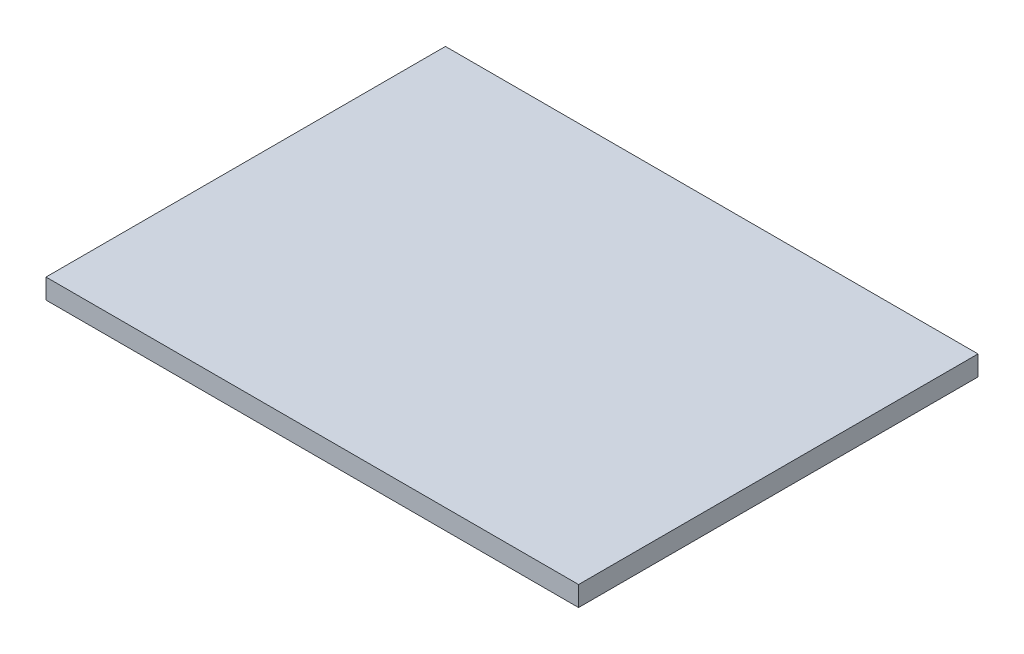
ISO-10303-21;
HEADER;
FILE_DESCRIPTION(('STEP AP214'),'2;1');
FILE_NAME('part.step','',(''),(''),'','','');
FILE_SCHEMA(('AUTOMOTIVE_DESIGN { 1 0 10303 214 1 1 1 1 }'));
ENDSEC;
DATA;
#1=APPLICATION_CONTEXT('core data for automotive mechanical design processes');
#2=APPLICATION_PROTOCOL_DEFINITION('international standard','automotive_design',2000,#1);
#3=PRODUCT_CONTEXT('',#1,'mechanical');
#4=PRODUCT('Part','Part','',(#3));
#5=PRODUCT_RELATED_PRODUCT_CATEGORY('part','',(#4));
#6=PRODUCT_DEFINITION_FORMATION('','',#4);
#7=PRODUCT_DEFINITION_CONTEXT('part definition',#1,'design');
#8=PRODUCT_DEFINITION('design','',#6,#7);
#9=PRODUCT_DEFINITION_SHAPE('','',#8);
#10=(LENGTH_UNIT() NAMED_UNIT(*) SI_UNIT(.MILLI.,.METRE.));
#11=(NAMED_UNIT(*) PLANE_ANGLE_UNIT() SI_UNIT($,.RADIAN.));
#12=(NAMED_UNIT(*) SI_UNIT($,.STERADIAN.) SOLID_ANGLE_UNIT());
#13=UNCERTAINTY_MEASURE_WITH_UNIT(LENGTH_MEASURE(1.E-05),#10,'distance_accuracy_value','');
#14=(GEOMETRIC_REPRESENTATION_CONTEXT(3) GLOBAL_UNCERTAINTY_ASSIGNED_CONTEXT((#13)) GLOBAL_UNIT_ASSIGNED_CONTEXT((#10,
#11,#12)) REPRESENTATION_CONTEXT('',''));
#15=CARTESIAN_POINT('',(0.,0.,0.));
#16=DIRECTION('',(0.,0.,1.));
#17=DIRECTION('',(1.,0.,0.));
#18=AXIS2_PLACEMENT_3D('',#15,#16,#17);
#19=CARTESIAN_POINT('',(200.,15.,-150.));
#20=DIRECTION('',(-1.,0.,0.));
#21=DIRECTION('',(0.,0.,1.));
#22=AXIS2_PLACEMENT_3D('',#19,#20,#21);
#23=PLANE('',#22);
#24=DIRECTION('',(0.,0.,-1.));
#25=VECTOR('',#24,1.);
#26=CARTESIAN_POINT('',(200.,0.,-150.));
#27=LINE('',#26,#25);
#28=CARTESIAN_POINT('',(200.,0.,150.));
#29=VERTEX_POINT('',#28);
#30=CARTESIAN_POINT('',(200.,0.,-150.));
#31=VERTEX_POINT('',#30);
#32=EDGE_CURVE('E97',#29,#31,#27,.T.);
#33=ORIENTED_EDGE('',*,*,#32,.T.);
#34=DIRECTION('',(0.,-1.,0.));
#35=VECTOR('',#34,1.);
#36=CARTESIAN_POINT('',(200.,15.,-150.));
#37=LINE('',#36,#35);
#38=CARTESIAN_POINT('',(200.,15.,-150.));
#39=VERTEX_POINT('',#38);
#40=EDGE_CURVE('E11',#39,#31,#37,.T.);
#41=ORIENTED_EDGE('',*,*,#40,.F.);
#42=DIRECTION('',(0.,0.,-1.));
#43=VECTOR('',#42,1.);
#44=CARTESIAN_POINT('',(200.,15.,-150.));
#45=LINE('',#44,#43);
#46=CARTESIAN_POINT('',(200.,15.,150.));
#47=VERTEX_POINT('',#46);
#48=EDGE_CURVE('E85',#47,#39,#45,.T.);
#49=ORIENTED_EDGE('',*,*,#48,.F.);
#50=DIRECTION('',(0.,-1.,0.));
#51=VECTOR('',#50,1.);
#52=CARTESIAN_POINT('',(200.,15.,150.));
#53=LINE('',#52,#51);
#54=EDGE_CURVE('E93',#47,#29,#53,.T.);
#55=ORIENTED_EDGE('',*,*,#54,.T.);
#56=EDGE_LOOP('',(#33,#41,#49,#55));
#57=FACE_BOUND('',#56,.T.);
#58=ADVANCED_FACE('F34',(#57),#23,.F.);
#59=CARTESIAN_POINT('',(-200.,15.,-150.));
#60=DIRECTION('',(0.,0.,1.));
#61=DIRECTION('',(1.,0.,0.));
#62=AXIS2_PLACEMENT_3D('',#59,#60,#61);
#63=PLANE('',#62);
#64=DIRECTION('',(-1.,0.,0.));
#65=VECTOR('',#64,1.);
#66=CARTESIAN_POINT('',(-200.,0.,-150.));
#67=LINE('',#66,#65);
#68=CARTESIAN_POINT('',(-200.,0.,-150.));
#69=VERTEX_POINT('',#68);
#70=EDGE_CURVE('E89',#31,#69,#67,.T.);
#71=ORIENTED_EDGE('',*,*,#70,.T.);
#72=DIRECTION('',(0.,-1.,0.));
#73=VECTOR('',#72,1.);
#74=CARTESIAN_POINT('',(-200.,15.,-150.));
#75=LINE('',#74,#73);
#76=CARTESIAN_POINT('',(-200.,15.,-150.));
#77=VERTEX_POINT('',#76);
#78=EDGE_CURVE('E42',#77,#69,#75,.T.);
#79=ORIENTED_EDGE('',*,*,#78,.F.);
#80=DIRECTION('',(-1.,0.,0.));
#81=VECTOR('',#80,1.);
#82=CARTESIAN_POINT('',(-200.,15.,-150.));
#83=LINE('',#82,#81);
#84=EDGE_CURVE('E80',#39,#77,#83,.T.);
#85=ORIENTED_EDGE('',*,*,#84,.F.);
#86=ORIENTED_EDGE('',*,*,#40,.T.);
#87=EDGE_LOOP('',(#71,#79,#85,#86));
#88=FACE_BOUND('',#87,.T.);
#89=ADVANCED_FACE('F88',(#88),#63,.F.);
#90=CARTESIAN_POINT('',(-200.,15.,-150.));
#91=DIRECTION('',(1.,0.,0.));
#92=DIRECTION('',(0.,0.,-1.));
#93=AXIS2_PLACEMENT_3D('',#90,#91,#92);
#94=PLANE('',#93);
#95=DIRECTION('',(0.,0.,1.));
#96=VECTOR('',#95,1.);
#97=CARTESIAN_POINT('',(-200.,0.,-150.));
#98=LINE('',#97,#96);
#99=CARTESIAN_POINT('',(-200.,0.,150.));
#100=VERTEX_POINT('',#99);
#101=EDGE_CURVE('E67',#69,#100,#98,.T.);
#102=ORIENTED_EDGE('',*,*,#101,.T.);
#103=DIRECTION('',(0.,-1.,0.));
#104=VECTOR('',#103,1.);
#105=CARTESIAN_POINT('',(-200.,15.,150.));
#106=LINE('',#105,#104);
#107=CARTESIAN_POINT('',(-200.,15.,150.));
#108=VERTEX_POINT('',#107);
#109=EDGE_CURVE('E90',#108,#100,#106,.T.);
#110=ORIENTED_EDGE('',*,*,#109,.F.);
#111=DIRECTION('',(0.,0.,1.));
#112=VECTOR('',#111,1.);
#113=CARTESIAN_POINT('',(-200.,15.,-150.));
#114=LINE('',#113,#112);
#115=EDGE_CURVE('E83',#77,#108,#114,.T.);
#116=ORIENTED_EDGE('',*,*,#115,.F.);
#117=ORIENTED_EDGE('',*,*,#78,.T.);
#118=EDGE_LOOP('',(#102,#110,#116,#117));
#119=FACE_BOUND('',#118,.T.);
#120=ADVANCED_FACE('F91',(#119),#94,.F.);
#121=CARTESIAN_POINT('',(-200.,15.,150.));
#122=DIRECTION('',(0.,0.,-1.));
#123=DIRECTION('',(-1.,0.,0.));
#124=AXIS2_PLACEMENT_3D('',#121,#122,#123);
#125=PLANE('',#124);
#126=DIRECTION('',(1.,0.,0.));
#127=VECTOR('',#126,1.);
#128=CARTESIAN_POINT('',(-200.,0.,150.));
#129=LINE('',#128,#127);
#130=EDGE_CURVE('E73',#100,#29,#129,.T.);
#131=ORIENTED_EDGE('',*,*,#130,.T.);
#132=ORIENTED_EDGE('',*,*,#54,.F.);
#133=DIRECTION('',(1.,0.,0.));
#134=VECTOR('',#133,1.);
#135=CARTESIAN_POINT('',(-200.,15.,150.));
#136=LINE('',#135,#134);
#137=EDGE_CURVE('E50',#108,#47,#136,.T.);
#138=ORIENTED_EDGE('',*,*,#137,.F.);
#139=ORIENTED_EDGE('',*,*,#109,.T.);
#140=EDGE_LOOP('',(#131,#132,#138,#139));
#141=FACE_BOUND('',#140,.T.);
#142=ADVANCED_FACE('F104',(#141),#125,.F.);
#143=CARTESIAN_POINT('',(0.,15.,0.));
#144=DIRECTION('',(0.,1.,0.));
#145=DIRECTION('',(0.,0.,1.));
#146=AXIS2_PLACEMENT_3D('',#143,#144,#145);
#147=PLANE('',#146);
#148=ORIENTED_EDGE('',*,*,#48,.T.);
#149=ORIENTED_EDGE('',*,*,#84,.T.);
#150=ORIENTED_EDGE('',*,*,#115,.T.);
#151=ORIENTED_EDGE('',*,*,#137,.T.);
#152=EDGE_LOOP('',(#148,#149,#150,#151));
#153=FACE_BOUND('',#152,.T.);
#154=ADVANCED_FACE('F81',(#153),#147,.T.);
#155=CARTESIAN_POINT('',(0.,0.,0.));
#156=DIRECTION('',(0.,1.,0.));
#157=DIRECTION('',(0.,0.,1.));
#158=AXIS2_PLACEMENT_3D('',#155,#156,#157);
#159=PLANE('',#158);
#160=ORIENTED_EDGE('',*,*,#32,.F.);
#161=ORIENTED_EDGE('',*,*,#130,.F.);
#162=ORIENTED_EDGE('',*,*,#101,.F.);
#163=ORIENTED_EDGE('',*,*,#70,.F.);
#164=EDGE_LOOP('',(#160,#161,#162,#163));
#165=FACE_BOUND('',#164,.T.);
#166=ADVANCED_FACE('F107',(#165),#159,.F.);
#167=CLOSED_SHELL('',(#58,#89,#120,#142,#154,#166));
#168=MANIFOLD_SOLID_BREP('B2',#167);
#169=ADVANCED_BREP_SHAPE_REPRESENTATION('',(#18,#168),#14);
#170=SHAPE_DEFINITION_REPRESENTATION(#9,#169);
ENDSEC;
END-ISO-10303-21;
